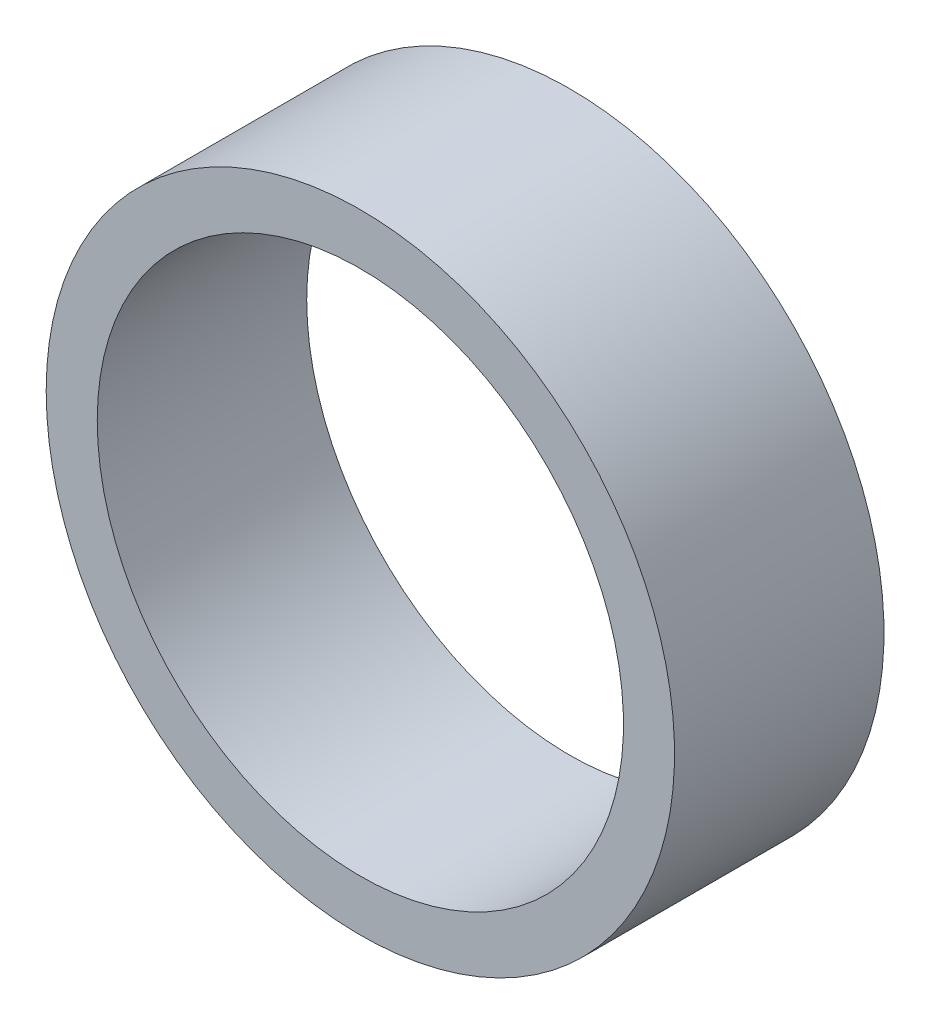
from build123d import *

# Parameters (mm, degrees)
LOGO3_BIB1_W = 1.548
LOGO3_BIB1_H = 6.35


with BuildPart() as part:
    # Logo3_bib1 → Revolve1 (revolve)
    with BuildSketch(Plane(origin=(0, 0, 0), x_dir=(-1, 0, 0), z_dir=(0, -1, 0))):
        with Locations((8.751, -3.175)):
            Rectangle(LOGO3_BIB1_W, LOGO3_BIB1_H)
    revolve(axis=Axis((0, 0, -38.976362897), (0, 0, 1)))


solid = part.part
